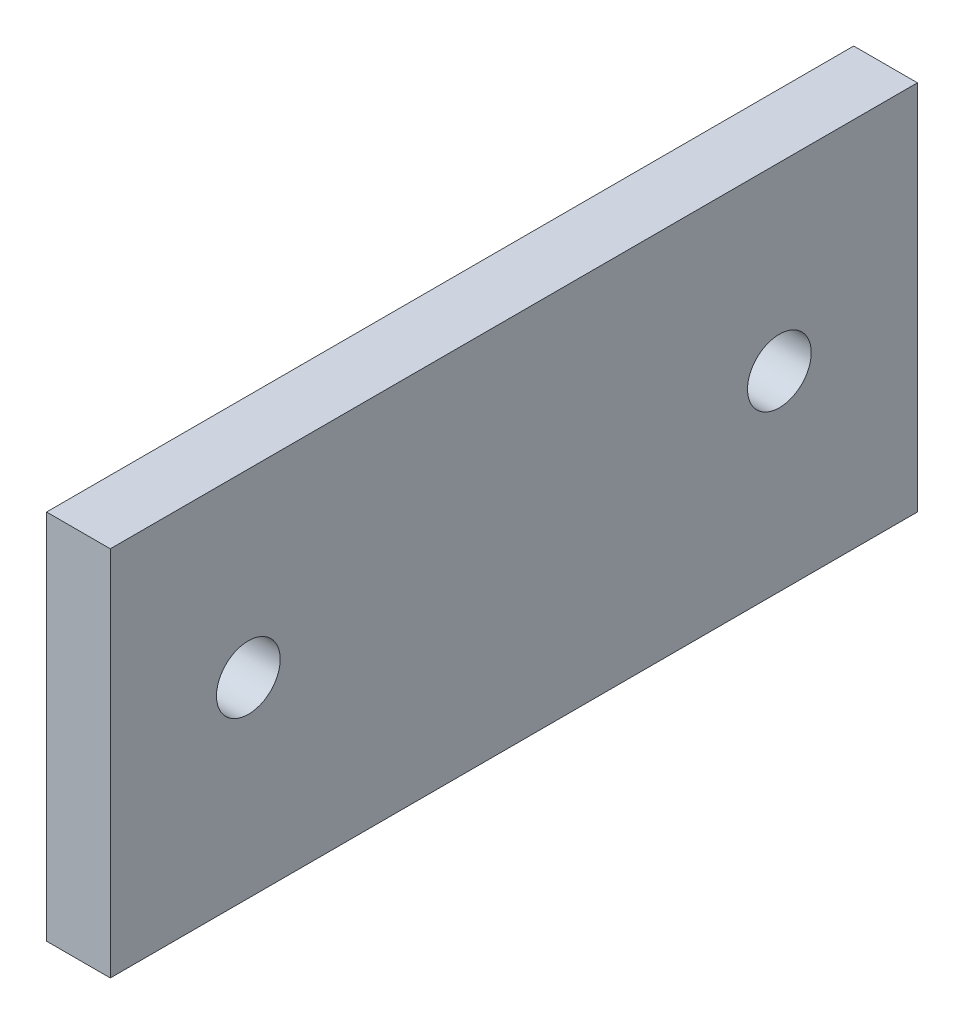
from build123d import *

# Parameters (mm, degrees)
SKETCH1_W           = 76
SKETCH1_H           = 35
SKETCH1_R           = 3
BOSS_EXTRUDE1_DEPTH = 3


with BuildPart() as part:
    # Sketch1 → Boss-Extrude1 (new, symmetric)
    with BuildSketch(Plane(origin=(0, 0, 0), x_dir=(0, 0, -1), z_dir=(1, 0, 0))):
        Rectangle(SKETCH1_W, SKETCH1_H)
        with Locations((25, 0.5)):
            Circle(SKETCH1_R, mode=Mode.SUBTRACT)
        with Locations(Location((-25, 0.5, 0), (0, 0, 180))):
            Circle(SKETCH1_R, mode=Mode.SUBTRACT)
    extrude(amount=BOSS_EXTRUDE1_DEPTH, both=True)


solid = part.part
